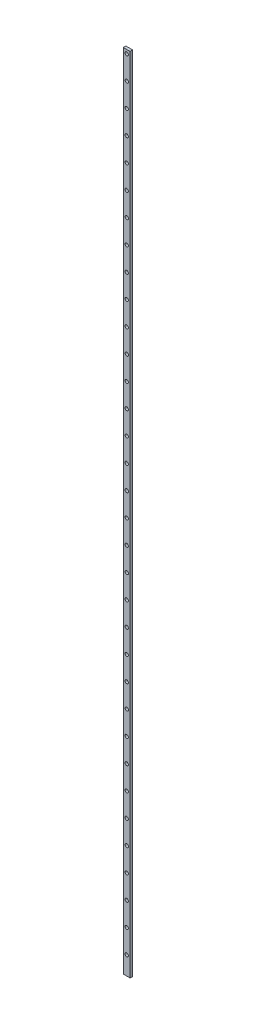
ISO-10303-21;
HEADER;
FILE_DESCRIPTION(('STEP AP214'),'2;1');
FILE_NAME('part.step','',(''),(''),'','','');
FILE_SCHEMA(('AUTOMOTIVE_DESIGN { 1 0 10303 214 1 1 1 1 }'));
ENDSEC;
DATA;
#1=APPLICATION_CONTEXT('core data for automotive mechanical design processes');
#2=APPLICATION_PROTOCOL_DEFINITION('international standard','automotive_design',2000,#1);
#3=PRODUCT_CONTEXT('',#1,'mechanical');
#4=PRODUCT('Part','Part','',(#3));
#5=PRODUCT_RELATED_PRODUCT_CATEGORY('part','',(#4));
#6=PRODUCT_DEFINITION_FORMATION('','',#4);
#7=PRODUCT_DEFINITION_CONTEXT('part definition',#1,'design');
#8=PRODUCT_DEFINITION('design','',#6,#7);
#9=PRODUCT_DEFINITION_SHAPE('','',#8);
#10=(LENGTH_UNIT() NAMED_UNIT(*) SI_UNIT(.MILLI.,.METRE.));
#11=(NAMED_UNIT(*) PLANE_ANGLE_UNIT() SI_UNIT($,.RADIAN.));
#12=(NAMED_UNIT(*) SI_UNIT($,.STERADIAN.) SOLID_ANGLE_UNIT());
#13=UNCERTAINTY_MEASURE_WITH_UNIT(LENGTH_MEASURE(1.E-05),#10,'distance_accuracy_value','');
#14=(GEOMETRIC_REPRESENTATION_CONTEXT(3) GLOBAL_UNCERTAINTY_ASSIGNED_CONTEXT((#13)) GLOBAL_UNIT_ASSIGNED_CONTEXT((#10,
#11,#12)) REPRESENTATION_CONTEXT('',''));
#15=CARTESIAN_POINT('',(0.,0.,0.));
#16=DIRECTION('',(0.,0.,1.));
#17=DIRECTION('',(1.,0.,0.));
#18=AXIS2_PLACEMENT_3D('',#15,#16,#17);
#19=CARTESIAN_POINT('',(0.,0.,4.8));
#20=DIRECTION('',(0.,-1.,0.));
#21=DIRECTION('',(0.,0.,-1.));
#22=AXIS2_PLACEMENT_3D('',#19,#20,#21);
#23=PLANE('',#22);
#24=DIRECTION('',(-1.,0.,0.));
#25=VECTOR('',#24,1.);
#26=CARTESIAN_POINT('',(0.,0.,0.));
#27=LINE('',#26,#25);
#28=CARTESIAN_POINT('',(0.,0.,0.));
#29=VERTEX_POINT('',#28);
#30=CARTESIAN_POINT('',(-12.7,0.,0.));
#31=VERTEX_POINT('',#30);
#32=EDGE_CURVE('E104',#29,#31,#27,.T.);
#33=ORIENTED_EDGE('',*,*,#32,.T.);
#34=DIRECTION('',(0.,0.,-1.));
#35=VECTOR('',#34,1.);
#36=CARTESIAN_POINT('',(-12.7,0.,4.8));
#37=LINE('',#36,#35);
#38=CARTESIAN_POINT('',(-12.7,0.,4.8));
#39=VERTEX_POINT('',#38);
#40=EDGE_CURVE('E95',#39,#31,#37,.T.);
#41=ORIENTED_EDGE('',*,*,#40,.F.);
#42=DIRECTION('',(-1.,0.,0.));
#43=VECTOR('',#42,1.);
#44=CARTESIAN_POINT('',(0.,0.,4.8));
#45=LINE('',#44,#43);
#46=CARTESIAN_POINT('',(0.,0.,4.8));
#47=VERTEX_POINT('',#46);
#48=EDGE_CURVE('E89',#47,#39,#45,.T.);
#49=ORIENTED_EDGE('',*,*,#48,.F.);
#50=DIRECTION('',(0.,0.,-1.));
#51=VECTOR('',#50,1.);
#52=CARTESIAN_POINT('',(0.,0.,4.8));
#53=LINE('',#52,#51);
#54=EDGE_CURVE('E100',#47,#29,#53,.T.);
#55=ORIENTED_EDGE('',*,*,#54,.T.);
#56=EDGE_LOOP('',(#33,#41,#49,#55));
#57=FACE_BOUND('',#56,.T.);
#58=ADVANCED_FACE('F35',(#57),#23,.F.);
#59=CARTESIAN_POINT('',(-12.7,0.,4.8));
#60=DIRECTION('',(1.,0.,0.));
#61=DIRECTION('',(0.,1.,0.));
#62=AXIS2_PLACEMENT_3D('',#59,#60,#61);
#63=PLANE('',#62);
#64=DIRECTION('',(0.,-1.,0.));
#65=VECTOR('',#64,1.);
#66=CARTESIAN_POINT('',(-12.7,0.,0.));
#67=LINE('',#66,#65);
#68=CARTESIAN_POINT('',(-12.6999999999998,-1500.,0.));
#69=VERTEX_POINT('',#68);
#70=EDGE_CURVE('E94',#31,#69,#67,.T.);
#71=ORIENTED_EDGE('',*,*,#70,.T.);
#72=DIRECTION('',(0.,0.,-1.));
#73=VECTOR('',#72,1.);
#74=CARTESIAN_POINT('',(-12.6999999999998,-1500.,4.8));
#75=LINE('',#74,#73);
#76=CARTESIAN_POINT('',(-12.6999999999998,-1500.,4.8));
#77=VERTEX_POINT('',#76);
#78=EDGE_CURVE('E92',#77,#69,#75,.T.);
#79=ORIENTED_EDGE('',*,*,#78,.F.);
#80=DIRECTION('',(0.,-1.,0.));
#81=VECTOR('',#80,1.);
#82=CARTESIAN_POINT('',(-12.7,0.,4.8));
#83=LINE('',#82,#81);
#84=EDGE_CURVE('E83',#39,#77,#83,.T.);
#85=ORIENTED_EDGE('',*,*,#84,.F.);
#86=ORIENTED_EDGE('',*,*,#40,.T.);
#87=EDGE_LOOP('',(#71,#79,#85,#86));
#88=FACE_BOUND('',#87,.T.);
#89=ADVANCED_FACE('F93',(#88),#63,.F.);
#90=CARTESIAN_POINT('',(-12.6999999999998,-1500.,4.8));
#91=DIRECTION('',(0.,1.,0.));
#92=DIRECTION('',(0.,0.,1.));
#93=AXIS2_PLACEMENT_3D('',#90,#91,#92);
#94=PLANE('',#93);
#95=DIRECTION('',(1.,0.,0.));
#96=VECTOR('',#95,1.);
#97=CARTESIAN_POINT('',(-12.6999999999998,-1500.,0.));
#98=LINE('',#97,#96);
#99=CARTESIAN_POINT('',(0.,-1500.,0.));
#100=VERTEX_POINT('',#99);
#101=EDGE_CURVE('E69',#69,#100,#98,.T.);
#102=ORIENTED_EDGE('',*,*,#101,.T.);
#103=DIRECTION('',(0.,0.,-1.));
#104=VECTOR('',#103,1.);
#105=CARTESIAN_POINT('',(0.,-1500.,4.8));
#106=LINE('',#105,#104);
#107=CARTESIAN_POINT('',(0.,-1500.,4.8));
#108=VERTEX_POINT('',#107);
#109=EDGE_CURVE('E96',#108,#100,#106,.T.);
#110=ORIENTED_EDGE('',*,*,#109,.F.);
#111=DIRECTION('',(1.,0.,0.));
#112=VECTOR('',#111,1.);
#113=CARTESIAN_POINT('',(-12.6999999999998,-1500.,4.8));
#114=LINE('',#113,#112);
#115=EDGE_CURVE('E87',#77,#108,#114,.T.);
#116=ORIENTED_EDGE('',*,*,#115,.F.);
#117=ORIENTED_EDGE('',*,*,#78,.T.);
#118=EDGE_LOOP('',(#102,#110,#116,#117));
#119=FACE_BOUND('',#118,.T.);
#120=ADVANCED_FACE('F98',(#119),#94,.F.);
#121=CARTESIAN_POINT('',(0.,-1500.,4.8));
#122=DIRECTION('',(-1.,0.,0.));
#123=DIRECTION('',(0.,0.,1.));
#124=AXIS2_PLACEMENT_3D('',#121,#122,#123);
#125=PLANE('',#124);
#126=DIRECTION('',(0.,1.,0.));
#127=VECTOR('',#126,1.);
#128=CARTESIAN_POINT('',(0.,-1500.,0.));
#129=LINE('',#128,#127);
#130=EDGE_CURVE('E75',#100,#29,#129,.T.);
#131=ORIENTED_EDGE('',*,*,#130,.T.);
#132=ORIENTED_EDGE('',*,*,#54,.F.);
#133=DIRECTION('',(0.,1.,0.));
#134=VECTOR('',#133,1.);
#135=CARTESIAN_POINT('',(0.,-1500.,4.8));
#136=LINE('',#135,#134);
#137=EDGE_CURVE('E52',#108,#47,#136,.T.);
#138=ORIENTED_EDGE('',*,*,#137,.F.);
#139=ORIENTED_EDGE('',*,*,#109,.T.);
#140=EDGE_LOOP('',(#131,#132,#138,#139));
#141=FACE_BOUND('',#140,.T.);
#142=ADVANCED_FACE('F310',(#141),#125,.F.);
#143=CARTESIAN_POINT('',(-12.7,0.,4.8));
#144=DIRECTION('',(0.,0.,1.));
#145=DIRECTION('',(1.,0.,0.));
#146=AXIS2_PLACEMENT_3D('',#143,#144,#145);
#147=PLANE('',#146);
#148=CARTESIAN_POINT('',(-6.35,-1421.45,4.8));
#149=DIRECTION('',(0.,0.,1.));
#150=DIRECTION('',(1.,0.,0.));
#151=AXIS2_PLACEMENT_3D('',#148,#149,#150);
#152=CIRCLE('',#151,3.14999999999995);
#153=CARTESIAN_POINT('',(-3.20000000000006,-1421.45,4.8));
#154=VERTEX_POINT('',#153);
#155=EDGE_CURVE('E708',#154,#154,#152,.T.);
#156=ORIENTED_EDGE('',*,*,#155,.F.);
#157=EDGE_LOOP('',(#156));
#158=FACE_BOUND('',#157,.T.);
#159=CARTESIAN_POINT('',(-6.35,-1465.65,4.8));
#160=DIRECTION('',(0.,0.,1.));
#161=DIRECTION('',(1.,0.,0.));
#162=AXIS2_PLACEMENT_3D('',#159,#160,#161);
#163=CIRCLE('',#162,3.14999999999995);
#164=CARTESIAN_POINT('',(-3.20000000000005,-1465.65,4.8));
#165=VERTEX_POINT('',#164);
#166=EDGE_CURVE('E707',#165,#165,#163,.T.);
#167=ORIENTED_EDGE('',*,*,#166,.F.);
#168=EDGE_LOOP('',(#167));
#169=FACE_BOUND('',#168,.T.);
#170=ORIENTED_EDGE('',*,*,#48,.T.);
#171=ORIENTED_EDGE('',*,*,#84,.T.);
#172=ORIENTED_EDGE('',*,*,#115,.T.);
#173=ORIENTED_EDGE('',*,*,#137,.T.);
#174=EDGE_LOOP('',(#170,#171,#172,#173));
#175=FACE_BOUND('',#174,.T.);
#176=CARTESIAN_POINT('',(-6.35000000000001,-1377.25,4.8));
#177=DIRECTION('',(0.,0.,1.));
#178=DIRECTION('',(1.,0.,0.));
#179=AXIS2_PLACEMENT_3D('',#176,#177,#178);
#180=CIRCLE('',#179,3.14999999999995);
#181=CARTESIAN_POINT('',(-3.20000000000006,-1377.25,4.8));
#182=VERTEX_POINT('',#181);
#183=EDGE_CURVE('E117',#182,#182,#180,.T.);
#184=ORIENTED_EDGE('',*,*,#183,.F.);
#185=EDGE_LOOP('',(#184));
#186=FACE_BOUND('',#185,.T.);
#187=CARTESIAN_POINT('',(-6.35000000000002,-1333.05,4.8));
#188=DIRECTION('',(0.,0.,1.));
#189=DIRECTION('',(1.,0.,0.));
#190=AXIS2_PLACEMENT_3D('',#187,#188,#189);
#191=CIRCLE('',#190,3.14999999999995);
#192=CARTESIAN_POINT('',(-3.20000000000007,-1333.05,4.8));
#193=VERTEX_POINT('',#192);
#194=EDGE_CURVE('E123',#193,#193,#191,.T.);
#195=ORIENTED_EDGE('',*,*,#194,.F.);
#196=EDGE_LOOP('',(#195));
#197=FACE_BOUND('',#196,.T.);
#198=CARTESIAN_POINT('',(-6.35000000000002,-1288.85,4.8));
#199=DIRECTION('',(0.,0.,1.));
#200=DIRECTION('',(1.,0.,0.));
#201=AXIS2_PLACEMENT_3D('',#198,#199,#200);
#202=CIRCLE('',#201,3.14999999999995);
#203=CARTESIAN_POINT('',(-3.20000000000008,-1288.85,4.8));
#204=VERTEX_POINT('',#203);
#205=EDGE_CURVE('E129',#204,#204,#202,.T.);
#206=ORIENTED_EDGE('',*,*,#205,.F.);
#207=EDGE_LOOP('',(#206));
#208=FACE_BOUND('',#207,.T.);
#209=CARTESIAN_POINT('',(-6.35000000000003,-1244.65,4.8));
#210=DIRECTION('',(0.,0.,1.));
#211=DIRECTION('',(1.,0.,0.));
#212=AXIS2_PLACEMENT_3D('',#209,#210,#211);
#213=CIRCLE('',#212,3.14999999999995);
#214=CARTESIAN_POINT('',(-3.20000000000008,-1244.65,4.8));
#215=VERTEX_POINT('',#214);
#216=EDGE_CURVE('E135',#215,#215,#213,.T.);
#217=ORIENTED_EDGE('',*,*,#216,.F.);
#218=EDGE_LOOP('',(#217));
#219=FACE_BOUND('',#218,.T.);
#220=CARTESIAN_POINT('',(-6.35000000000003,-1200.45,4.8));
#221=DIRECTION('',(0.,0.,1.));
#222=DIRECTION('',(1.,0.,0.));
#223=AXIS2_PLACEMENT_3D('',#220,#221,#222);
#224=CIRCLE('',#223,3.14999999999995);
#225=CARTESIAN_POINT('',(-3.20000000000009,-1200.45,4.8));
#226=VERTEX_POINT('',#225);
#227=EDGE_CURVE('E141',#226,#226,#224,.T.);
#228=ORIENTED_EDGE('',*,*,#227,.F.);
#229=EDGE_LOOP('',(#228));
#230=FACE_BOUND('',#229,.T.);
#231=CARTESIAN_POINT('',(-6.35000000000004,-1156.25,4.8));
#232=DIRECTION('',(0.,0.,1.));
#233=DIRECTION('',(1.,0.,0.));
#234=AXIS2_PLACEMENT_3D('',#231,#232,#233);
#235=CIRCLE('',#234,3.14999999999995);
#236=CARTESIAN_POINT('',(-3.20000000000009,-1156.25,4.8));
#237=VERTEX_POINT('',#236);
#238=EDGE_CURVE('E147',#237,#237,#235,.T.);
#239=ORIENTED_EDGE('',*,*,#238,.F.);
#240=EDGE_LOOP('',(#239));
#241=FACE_BOUND('',#240,.T.);
#242=CARTESIAN_POINT('',(-6.35000000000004,-1112.05,4.8));
#243=DIRECTION('',(0.,0.,1.));
#244=DIRECTION('',(1.,0.,0.));
#245=AXIS2_PLACEMENT_3D('',#242,#243,#244);
#246=CIRCLE('',#245,3.14999999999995);
#247=CARTESIAN_POINT('',(-3.2000000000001,-1112.05,4.8));
#248=VERTEX_POINT('',#247);
#249=EDGE_CURVE('E153',#248,#248,#246,.T.);
#250=ORIENTED_EDGE('',*,*,#249,.F.);
#251=EDGE_LOOP('',(#250));
#252=FACE_BOUND('',#251,.T.);
#253=CARTESIAN_POINT('',(-6.35000000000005,-1067.85,4.8));
#254=DIRECTION('',(0.,0.,1.));
#255=DIRECTION('',(1.,0.,0.));
#256=AXIS2_PLACEMENT_3D('',#253,#254,#255);
#257=CIRCLE('',#256,3.14999999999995);
#258=CARTESIAN_POINT('',(-3.2000000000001,-1067.85,4.8));
#259=VERTEX_POINT('',#258);
#260=EDGE_CURVE('E159',#259,#259,#257,.T.);
#261=ORIENTED_EDGE('',*,*,#260,.F.);
#262=EDGE_LOOP('',(#261));
#263=FACE_BOUND('',#262,.T.);
#264=CARTESIAN_POINT('',(-6.35000000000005,-1023.65,4.8));
#265=DIRECTION('',(0.,0.,1.));
#266=DIRECTION('',(1.,0.,0.));
#267=AXIS2_PLACEMENT_3D('',#264,#265,#266);
#268=CIRCLE('',#267,3.14999999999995);
#269=CARTESIAN_POINT('',(-3.20000000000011,-1023.65,4.8));
#270=VERTEX_POINT('',#269);
#271=EDGE_CURVE('E165',#270,#270,#268,.T.);
#272=ORIENTED_EDGE('',*,*,#271,.F.);
#273=EDGE_LOOP('',(#272));
#274=FACE_BOUND('',#273,.T.);
#275=CARTESIAN_POINT('',(-6.35000000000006,-979.45,4.8));
#276=DIRECTION('',(0.,0.,1.));
#277=DIRECTION('',(1.,0.,0.));
#278=AXIS2_PLACEMENT_3D('',#275,#276,#277);
#279=CIRCLE('',#278,3.14999999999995);
#280=CARTESIAN_POINT('',(-3.20000000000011,-979.45,4.8));
#281=VERTEX_POINT('',#280);
#282=EDGE_CURVE('E171',#281,#281,#279,.T.);
#283=ORIENTED_EDGE('',*,*,#282,.F.);
#284=EDGE_LOOP('',(#283));
#285=FACE_BOUND('',#284,.T.);
#286=CARTESIAN_POINT('',(-6.35000000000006,-935.25,4.8));
#287=DIRECTION('',(0.,0.,1.));
#288=DIRECTION('',(1.,0.,0.));
#289=AXIS2_PLACEMENT_3D('',#286,#287,#288);
#290=CIRCLE('',#289,3.14999999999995);
#291=CARTESIAN_POINT('',(-3.20000000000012,-935.25,4.8));
#292=VERTEX_POINT('',#291);
#293=EDGE_CURVE('E177',#292,#292,#290,.T.);
#294=ORIENTED_EDGE('',*,*,#293,.F.);
#295=EDGE_LOOP('',(#294));
#296=FACE_BOUND('',#295,.T.);
#297=CARTESIAN_POINT('',(-6.35000000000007,-891.05,4.8));
#298=DIRECTION('',(0.,0.,1.));
#299=DIRECTION('',(1.,0.,0.));
#300=AXIS2_PLACEMENT_3D('',#297,#298,#299);
#301=CIRCLE('',#300,3.14999999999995);
#302=CARTESIAN_POINT('',(-3.20000000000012,-891.05,4.8));
#303=VERTEX_POINT('',#302);
#304=EDGE_CURVE('E183',#303,#303,#301,.T.);
#305=ORIENTED_EDGE('',*,*,#304,.F.);
#306=EDGE_LOOP('',(#305));
#307=FACE_BOUND('',#306,.T.);
#308=CARTESIAN_POINT('',(-6.35000000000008,-846.85,4.8));
#309=DIRECTION('',(0.,0.,1.));
#310=DIRECTION('',(1.,0.,0.));
#311=AXIS2_PLACEMENT_3D('',#308,#309,#310);
#312=CIRCLE('',#311,3.14999999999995);
#313=CARTESIAN_POINT('',(-3.20000000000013,-846.85,4.8));
#314=VERTEX_POINT('',#313);
#315=EDGE_CURVE('E189',#314,#314,#312,.T.);
#316=ORIENTED_EDGE('',*,*,#315,.F.);
#317=EDGE_LOOP('',(#316));
#318=FACE_BOUND('',#317,.T.);
#319=CARTESIAN_POINT('',(-6.35000000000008,-802.65,4.8));
#320=DIRECTION('',(0.,0.,1.));
#321=DIRECTION('',(1.,0.,0.));
#322=AXIS2_PLACEMENT_3D('',#319,#320,#321);
#323=CIRCLE('',#322,3.14999999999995);
#324=CARTESIAN_POINT('',(-3.20000000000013,-802.65,4.8));
#325=VERTEX_POINT('',#324);
#326=EDGE_CURVE('E195',#325,#325,#323,.T.);
#327=ORIENTED_EDGE('',*,*,#326,.F.);
#328=EDGE_LOOP('',(#327));
#329=FACE_BOUND('',#328,.T.);
#330=CARTESIAN_POINT('',(-6.35000000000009,-758.45,4.8));
#331=DIRECTION('',(0.,0.,1.));
#332=DIRECTION('',(1.,0.,0.));
#333=AXIS2_PLACEMENT_3D('',#330,#331,#332);
#334=CIRCLE('',#333,3.14999999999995);
#335=CARTESIAN_POINT('',(-3.20000000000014,-758.45,4.8));
#336=VERTEX_POINT('',#335);
#337=EDGE_CURVE('E201',#336,#336,#334,.T.);
#338=ORIENTED_EDGE('',*,*,#337,.F.);
#339=EDGE_LOOP('',(#338));
#340=FACE_BOUND('',#339,.T.);
#341=CARTESIAN_POINT('',(-6.35000000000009,-714.25,4.8));
#342=DIRECTION('',(0.,0.,1.));
#343=DIRECTION('',(1.,0.,0.));
#344=AXIS2_PLACEMENT_3D('',#341,#342,#343);
#345=CIRCLE('',#344,3.14999999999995);
#346=CARTESIAN_POINT('',(-3.20000000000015,-714.25,4.8));
#347=VERTEX_POINT('',#346);
#348=EDGE_CURVE('E207',#347,#347,#345,.T.);
#349=ORIENTED_EDGE('',*,*,#348,.F.);
#350=EDGE_LOOP('',(#349));
#351=FACE_BOUND('',#350,.T.);
#352=CARTESIAN_POINT('',(-6.3500000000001,-670.05,4.8));
#353=DIRECTION('',(0.,0.,1.));
#354=DIRECTION('',(1.,0.,0.));
#355=AXIS2_PLACEMENT_3D('',#352,#353,#354);
#356=CIRCLE('',#355,3.14999999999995);
#357=CARTESIAN_POINT('',(-3.20000000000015,-670.05,4.8));
#358=VERTEX_POINT('',#357);
#359=EDGE_CURVE('E213',#358,#358,#356,.T.);
#360=ORIENTED_EDGE('',*,*,#359,.F.);
#361=EDGE_LOOP('',(#360));
#362=FACE_BOUND('',#361,.T.);
#363=CARTESIAN_POINT('',(-6.3500000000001,-625.85,4.8));
#364=DIRECTION('',(0.,0.,1.));
#365=DIRECTION('',(1.,0.,0.));
#366=AXIS2_PLACEMENT_3D('',#363,#364,#365);
#367=CIRCLE('',#366,3.14999999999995);
#368=CARTESIAN_POINT('',(-3.20000000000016,-625.85,4.8));
#369=VERTEX_POINT('',#368);
#370=EDGE_CURVE('E219',#369,#369,#367,.T.);
#371=ORIENTED_EDGE('',*,*,#370,.F.);
#372=EDGE_LOOP('',(#371));
#373=FACE_BOUND('',#372,.T.);
#374=CARTESIAN_POINT('',(-6.35000000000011,-581.65,4.8));
#375=DIRECTION('',(0.,0.,1.));
#376=DIRECTION('',(1.,0.,0.));
#377=AXIS2_PLACEMENT_3D('',#374,#375,#376);
#378=CIRCLE('',#377,3.14999999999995);
#379=CARTESIAN_POINT('',(-3.20000000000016,-581.65,4.8));
#380=VERTEX_POINT('',#379);
#381=EDGE_CURVE('E225',#380,#380,#378,.T.);
#382=ORIENTED_EDGE('',*,*,#381,.F.);
#383=EDGE_LOOP('',(#382));
#384=FACE_BOUND('',#383,.T.);
#385=CARTESIAN_POINT('',(-6.35000000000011,-537.45,4.8));
#386=DIRECTION('',(0.,0.,1.));
#387=DIRECTION('',(1.,0.,0.));
#388=AXIS2_PLACEMENT_3D('',#385,#386,#387);
#389=CIRCLE('',#388,3.14999999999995);
#390=CARTESIAN_POINT('',(-3.20000000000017,-537.45,4.8));
#391=VERTEX_POINT('',#390);
#392=EDGE_CURVE('E231',#391,#391,#389,.T.);
#393=ORIENTED_EDGE('',*,*,#392,.F.);
#394=EDGE_LOOP('',(#393));
#395=FACE_BOUND('',#394,.T.);
#396=CARTESIAN_POINT('',(-6.35000000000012,-493.25,4.8));
#397=DIRECTION('',(0.,0.,1.));
#398=DIRECTION('',(1.,0.,0.));
#399=AXIS2_PLACEMENT_3D('',#396,#397,#398);
#400=CIRCLE('',#399,3.14999999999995);
#401=CARTESIAN_POINT('',(-3.20000000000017,-493.25,4.8));
#402=VERTEX_POINT('',#401);
#403=EDGE_CURVE('E237',#402,#402,#400,.T.);
#404=ORIENTED_EDGE('',*,*,#403,.F.);
#405=EDGE_LOOP('',(#404));
#406=FACE_BOUND('',#405,.T.);
#407=CARTESIAN_POINT('',(-6.35000000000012,-449.05,4.8));
#408=DIRECTION('',(0.,0.,1.));
#409=DIRECTION('',(1.,0.,0.));
#410=AXIS2_PLACEMENT_3D('',#407,#408,#409);
#411=CIRCLE('',#410,3.14999999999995);
#412=CARTESIAN_POINT('',(-3.20000000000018,-449.05,4.8));
#413=VERTEX_POINT('',#412);
#414=EDGE_CURVE('E243',#413,#413,#411,.T.);
#415=ORIENTED_EDGE('',*,*,#414,.F.);
#416=EDGE_LOOP('',(#415));
#417=FACE_BOUND('',#416,.T.);
#418=CARTESIAN_POINT('',(-6.35000000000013,-404.85,4.8));
#419=DIRECTION('',(0.,0.,1.));
#420=DIRECTION('',(1.,0.,0.));
#421=AXIS2_PLACEMENT_3D('',#418,#419,#420);
#422=CIRCLE('',#421,3.14999999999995);
#423=CARTESIAN_POINT('',(-3.20000000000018,-404.85,4.8));
#424=VERTEX_POINT('',#423);
#425=EDGE_CURVE('E249',#424,#424,#422,.T.);
#426=ORIENTED_EDGE('',*,*,#425,.F.);
#427=EDGE_LOOP('',(#426));
#428=FACE_BOUND('',#427,.T.);
#429=CARTESIAN_POINT('',(-6.35000000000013,-360.65,4.8));
#430=DIRECTION('',(0.,0.,1.));
#431=DIRECTION('',(1.,0.,0.));
#432=AXIS2_PLACEMENT_3D('',#429,#430,#431);
#433=CIRCLE('',#432,3.14999999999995);
#434=CARTESIAN_POINT('',(-3.20000000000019,-360.65,4.8));
#435=VERTEX_POINT('',#434);
#436=EDGE_CURVE('E255',#435,#435,#433,.T.);
#437=ORIENTED_EDGE('',*,*,#436,.F.);
#438=EDGE_LOOP('',(#437));
#439=FACE_BOUND('',#438,.T.);
#440=CARTESIAN_POINT('',(-6.35000000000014,-316.45,4.8));
#441=DIRECTION('',(0.,0.,1.));
#442=DIRECTION('',(1.,0.,0.));
#443=AXIS2_PLACEMENT_3D('',#440,#441,#442);
#444=CIRCLE('',#443,3.14999999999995);
#445=CARTESIAN_POINT('',(-3.20000000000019,-316.45,4.8));
#446=VERTEX_POINT('',#445);
#447=EDGE_CURVE('E261',#446,#446,#444,.T.);
#448=ORIENTED_EDGE('',*,*,#447,.F.);
#449=EDGE_LOOP('',(#448));
#450=FACE_BOUND('',#449,.T.);
#451=CARTESIAN_POINT('',(-6.35000000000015,-272.25,4.8));
#452=DIRECTION('',(0.,0.,1.));
#453=DIRECTION('',(1.,0.,0.));
#454=AXIS2_PLACEMENT_3D('',#451,#452,#453);
#455=CIRCLE('',#454,3.14999999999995);
#456=CARTESIAN_POINT('',(-3.2000000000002,-272.25,4.8));
#457=VERTEX_POINT('',#456);
#458=EDGE_CURVE('E267',#457,#457,#455,.T.);
#459=ORIENTED_EDGE('',*,*,#458,.F.);
#460=EDGE_LOOP('',(#459));
#461=FACE_BOUND('',#460,.T.);
#462=CARTESIAN_POINT('',(-6.35000000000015,-228.05,4.8));
#463=DIRECTION('',(0.,0.,1.));
#464=DIRECTION('',(1.,0.,0.));
#465=AXIS2_PLACEMENT_3D('',#462,#463,#464);
#466=CIRCLE('',#465,3.14999999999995);
#467=CARTESIAN_POINT('',(-3.20000000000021,-228.05,4.8));
#468=VERTEX_POINT('',#467);
#469=EDGE_CURVE('E273',#468,#468,#466,.T.);
#470=ORIENTED_EDGE('',*,*,#469,.F.);
#471=EDGE_LOOP('',(#470));
#472=FACE_BOUND('',#471,.T.);
#473=CARTESIAN_POINT('',(-6.35000000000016,-183.85,4.8));
#474=DIRECTION('',(0.,0.,1.));
#475=DIRECTION('',(1.,0.,0.));
#476=AXIS2_PLACEMENT_3D('',#473,#474,#475);
#477=CIRCLE('',#476,3.14999999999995);
#478=CARTESIAN_POINT('',(-3.20000000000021,-183.85,4.8));
#479=VERTEX_POINT('',#478);
#480=EDGE_CURVE('E279',#479,#479,#477,.T.);
#481=ORIENTED_EDGE('',*,*,#480,.F.);
#482=EDGE_LOOP('',(#481));
#483=FACE_BOUND('',#482,.T.);
#484=CARTESIAN_POINT('',(-6.35000000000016,-139.65,4.8));
#485=DIRECTION('',(0.,0.,1.));
#486=DIRECTION('',(1.,0.,0.));
#487=AXIS2_PLACEMENT_3D('',#484,#485,#486);
#488=CIRCLE('',#487,3.14999999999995);
#489=CARTESIAN_POINT('',(-3.20000000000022,-139.65,4.8));
#490=VERTEX_POINT('',#489);
#491=EDGE_CURVE('E285',#490,#490,#488,.T.);
#492=ORIENTED_EDGE('',*,*,#491,.F.);
#493=EDGE_LOOP('',(#492));
#494=FACE_BOUND('',#493,.T.);
#495=CARTESIAN_POINT('',(-6.35000000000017,-95.4499999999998,4.8));
#496=DIRECTION('',(0.,0.,1.));
#497=DIRECTION('',(1.,0.,0.));
#498=AXIS2_PLACEMENT_3D('',#495,#496,#497);
#499=CIRCLE('',#498,3.14999999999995);
#500=CARTESIAN_POINT('',(-3.20000000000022,-95.4499999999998,4.8));
#501=VERTEX_POINT('',#500);
#502=EDGE_CURVE('E291',#501,#501,#499,.T.);
#503=ORIENTED_EDGE('',*,*,#502,.F.);
#504=EDGE_LOOP('',(#503));
#505=FACE_BOUND('',#504,.T.);
#506=CARTESIAN_POINT('',(-6.35000000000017,-51.2499999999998,4.8));
#507=DIRECTION('',(0.,0.,1.));
#508=DIRECTION('',(1.,0.,0.));
#509=AXIS2_PLACEMENT_3D('',#506,#507,#508);
#510=CIRCLE('',#509,3.14999999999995);
#511=CARTESIAN_POINT('',(-3.20000000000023,-51.2499999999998,4.8));
#512=VERTEX_POINT('',#511);
#513=EDGE_CURVE('E297',#512,#512,#510,.T.);
#514=ORIENTED_EDGE('',*,*,#513,.F.);
#515=EDGE_LOOP('',(#514));
#516=FACE_BOUND('',#515,.T.);
#517=CARTESIAN_POINT('',(-6.35000000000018,-7.04999999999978,4.8));
#518=DIRECTION('',(0.,0.,1.));
#519=DIRECTION('',(1.,0.,0.));
#520=AXIS2_PLACEMENT_3D('',#517,#518,#519);
#521=CIRCLE('',#520,3.14999999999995);
#522=CARTESIAN_POINT('',(-3.20000000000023,-7.04999999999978,4.8));
#523=VERTEX_POINT('',#522);
#524=EDGE_CURVE('E11',#523,#523,#521,.T.);
#525=ORIENTED_EDGE('',*,*,#524,.F.);
#526=EDGE_LOOP('',(#525));
#527=FACE_BOUND('',#526,.T.);
#528=ADVANCED_FACE('F84',(#158,#169,#175,#186,#197,#208,#219,#230,#241,#252,#263,#274,#285,#296,
#307,#318,#329,#340,#351,#362,#373,#384,#395,#406,#417,#428,#439,#450,#461,#472,#483,#494,#505,
#516,#527),#147,.T.);
#529=CARTESIAN_POINT('',(-12.7,0.,0.));
#530=DIRECTION('',(0.,0.,1.));
#531=DIRECTION('',(1.,0.,0.));
#532=AXIS2_PLACEMENT_3D('',#529,#530,#531);
#533=PLANE('',#532);
#534=CARTESIAN_POINT('',(-6.35,-1421.45,0.));
#535=DIRECTION('',(0.,0.,1.));
#536=DIRECTION('',(1.,0.,0.));
#537=AXIS2_PLACEMENT_3D('',#534,#535,#536);
#538=CIRCLE('',#537,3.14999999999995);
#539=CARTESIAN_POINT('',(-3.20000000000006,-1421.45,0.));
#540=VERTEX_POINT('',#539);
#541=EDGE_CURVE('E712',#540,#540,#538,.T.);
#542=ORIENTED_EDGE('',*,*,#541,.T.);
#543=EDGE_LOOP('',(#542));
#544=FACE_BOUND('',#543,.T.);
#545=CARTESIAN_POINT('',(-6.35,-1465.65,0.));
#546=DIRECTION('',(0.,0.,1.));
#547=DIRECTION('',(1.,0.,0.));
#548=AXIS2_PLACEMENT_3D('',#545,#546,#547);
#549=CIRCLE('',#548,3.14999999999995);
#550=CARTESIAN_POINT('',(-3.20000000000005,-1465.65,0.));
#551=VERTEX_POINT('',#550);
#552=EDGE_CURVE('E107',#551,#551,#549,.T.);
#553=ORIENTED_EDGE('',*,*,#552,.T.);
#554=EDGE_LOOP('',(#553));
#555=FACE_BOUND('',#554,.T.);
#556=ORIENTED_EDGE('',*,*,#32,.F.);
#557=ORIENTED_EDGE('',*,*,#130,.F.);
#558=ORIENTED_EDGE('',*,*,#101,.F.);
#559=ORIENTED_EDGE('',*,*,#70,.F.);
#560=EDGE_LOOP('',(#556,#557,#558,#559));
#561=FACE_BOUND('',#560,.T.);
#562=CARTESIAN_POINT('',(-6.35000000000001,-1377.25,0.));
#563=DIRECTION('',(0.,0.,1.));
#564=DIRECTION('',(1.,0.,0.));
#565=AXIS2_PLACEMENT_3D('',#562,#563,#564);
#566=CIRCLE('',#565,3.14999999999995);
#567=CARTESIAN_POINT('',(-3.20000000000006,-1377.25,0.));
#568=VERTEX_POINT('',#567);
#569=EDGE_CURVE('E114',#568,#568,#566,.T.);
#570=ORIENTED_EDGE('',*,*,#569,.T.);
#571=EDGE_LOOP('',(#570));
#572=FACE_BOUND('',#571,.T.);
#573=CARTESIAN_POINT('',(-6.35000000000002,-1333.05,0.));
#574=DIRECTION('',(0.,0.,1.));
#575=DIRECTION('',(1.,0.,0.));
#576=AXIS2_PLACEMENT_3D('',#573,#574,#575);
#577=CIRCLE('',#576,3.14999999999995);
#578=CARTESIAN_POINT('',(-3.20000000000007,-1333.05,0.));
#579=VERTEX_POINT('',#578);
#580=EDGE_CURVE('E120',#579,#579,#577,.T.);
#581=ORIENTED_EDGE('',*,*,#580,.T.);
#582=EDGE_LOOP('',(#581));
#583=FACE_BOUND('',#582,.T.);
#584=CARTESIAN_POINT('',(-6.35000000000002,-1288.85,0.));
#585=DIRECTION('',(0.,0.,1.));
#586=DIRECTION('',(1.,0.,0.));
#587=AXIS2_PLACEMENT_3D('',#584,#585,#586);
#588=CIRCLE('',#587,3.14999999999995);
#589=CARTESIAN_POINT('',(-3.20000000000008,-1288.85,0.));
#590=VERTEX_POINT('',#589);
#591=EDGE_CURVE('E126',#590,#590,#588,.T.);
#592=ORIENTED_EDGE('',*,*,#591,.T.);
#593=EDGE_LOOP('',(#592));
#594=FACE_BOUND('',#593,.T.);
#595=CARTESIAN_POINT('',(-6.35000000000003,-1244.65,0.));
#596=DIRECTION('',(0.,0.,1.));
#597=DIRECTION('',(1.,0.,0.));
#598=AXIS2_PLACEMENT_3D('',#595,#596,#597);
#599=CIRCLE('',#598,3.14999999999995);
#600=CARTESIAN_POINT('',(-3.20000000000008,-1244.65,0.));
#601=VERTEX_POINT('',#600);
#602=EDGE_CURVE('E132',#601,#601,#599,.T.);
#603=ORIENTED_EDGE('',*,*,#602,.T.);
#604=EDGE_LOOP('',(#603));
#605=FACE_BOUND('',#604,.T.);
#606=CARTESIAN_POINT('',(-6.35000000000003,-1200.45,0.));
#607=DIRECTION('',(0.,0.,1.));
#608=DIRECTION('',(1.,0.,0.));
#609=AXIS2_PLACEMENT_3D('',#606,#607,#608);
#610=CIRCLE('',#609,3.14999999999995);
#611=CARTESIAN_POINT('',(-3.20000000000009,-1200.45,0.));
#612=VERTEX_POINT('',#611);
#613=EDGE_CURVE('E138',#612,#612,#610,.T.);
#614=ORIENTED_EDGE('',*,*,#613,.T.);
#615=EDGE_LOOP('',(#614));
#616=FACE_BOUND('',#615,.T.);
#617=CARTESIAN_POINT('',(-6.35000000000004,-1156.25,0.));
#618=DIRECTION('',(0.,0.,1.));
#619=DIRECTION('',(1.,0.,0.));
#620=AXIS2_PLACEMENT_3D('',#617,#618,#619);
#621=CIRCLE('',#620,3.14999999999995);
#622=CARTESIAN_POINT('',(-3.20000000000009,-1156.25,0.));
#623=VERTEX_POINT('',#622);
#624=EDGE_CURVE('E144',#623,#623,#621,.T.);
#625=ORIENTED_EDGE('',*,*,#624,.T.);
#626=EDGE_LOOP('',(#625));
#627=FACE_BOUND('',#626,.T.);
#628=CARTESIAN_POINT('',(-6.35000000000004,-1112.05,0.));
#629=DIRECTION('',(0.,0.,1.));
#630=DIRECTION('',(1.,0.,0.));
#631=AXIS2_PLACEMENT_3D('',#628,#629,#630);
#632=CIRCLE('',#631,3.14999999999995);
#633=CARTESIAN_POINT('',(-3.2000000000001,-1112.05,0.));
#634=VERTEX_POINT('',#633);
#635=EDGE_CURVE('E150',#634,#634,#632,.T.);
#636=ORIENTED_EDGE('',*,*,#635,.T.);
#637=EDGE_LOOP('',(#636));
#638=FACE_BOUND('',#637,.T.);
#639=CARTESIAN_POINT('',(-6.35000000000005,-1067.85,0.));
#640=DIRECTION('',(0.,0.,1.));
#641=DIRECTION('',(1.,0.,0.));
#642=AXIS2_PLACEMENT_3D('',#639,#640,#641);
#643=CIRCLE('',#642,3.14999999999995);
#644=CARTESIAN_POINT('',(-3.2000000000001,-1067.85,0.));
#645=VERTEX_POINT('',#644);
#646=EDGE_CURVE('E156',#645,#645,#643,.T.);
#647=ORIENTED_EDGE('',*,*,#646,.T.);
#648=EDGE_LOOP('',(#647));
#649=FACE_BOUND('',#648,.T.);
#650=CARTESIAN_POINT('',(-6.35000000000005,-1023.65,0.));
#651=DIRECTION('',(0.,0.,1.));
#652=DIRECTION('',(1.,0.,0.));
#653=AXIS2_PLACEMENT_3D('',#650,#651,#652);
#654=CIRCLE('',#653,3.14999999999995);
#655=CARTESIAN_POINT('',(-3.20000000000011,-1023.65,0.));
#656=VERTEX_POINT('',#655);
#657=EDGE_CURVE('E162',#656,#656,#654,.T.);
#658=ORIENTED_EDGE('',*,*,#657,.T.);
#659=EDGE_LOOP('',(#658));
#660=FACE_BOUND('',#659,.T.);
#661=CARTESIAN_POINT('',(-6.35000000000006,-979.45,0.));
#662=DIRECTION('',(0.,0.,1.));
#663=DIRECTION('',(1.,0.,0.));
#664=AXIS2_PLACEMENT_3D('',#661,#662,#663);
#665=CIRCLE('',#664,3.14999999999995);
#666=CARTESIAN_POINT('',(-3.20000000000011,-979.45,0.));
#667=VERTEX_POINT('',#666);
#668=EDGE_CURVE('E168',#667,#667,#665,.T.);
#669=ORIENTED_EDGE('',*,*,#668,.T.);
#670=EDGE_LOOP('',(#669));
#671=FACE_BOUND('',#670,.T.);
#672=CARTESIAN_POINT('',(-6.35000000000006,-935.25,0.));
#673=DIRECTION('',(0.,0.,1.));
#674=DIRECTION('',(1.,0.,0.));
#675=AXIS2_PLACEMENT_3D('',#672,#673,#674);
#676=CIRCLE('',#675,3.14999999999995);
#677=CARTESIAN_POINT('',(-3.20000000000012,-935.25,0.));
#678=VERTEX_POINT('',#677);
#679=EDGE_CURVE('E174',#678,#678,#676,.T.);
#680=ORIENTED_EDGE('',*,*,#679,.T.);
#681=EDGE_LOOP('',(#680));
#682=FACE_BOUND('',#681,.T.);
#683=CARTESIAN_POINT('',(-6.35000000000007,-891.05,0.));
#684=DIRECTION('',(0.,0.,1.));
#685=DIRECTION('',(1.,0.,0.));
#686=AXIS2_PLACEMENT_3D('',#683,#684,#685);
#687=CIRCLE('',#686,3.14999999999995);
#688=CARTESIAN_POINT('',(-3.20000000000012,-891.05,0.));
#689=VERTEX_POINT('',#688);
#690=EDGE_CURVE('E180',#689,#689,#687,.T.);
#691=ORIENTED_EDGE('',*,*,#690,.T.);
#692=EDGE_LOOP('',(#691));
#693=FACE_BOUND('',#692,.T.);
#694=CARTESIAN_POINT('',(-6.35000000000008,-846.85,0.));
#695=DIRECTION('',(0.,0.,1.));
#696=DIRECTION('',(1.,0.,0.));
#697=AXIS2_PLACEMENT_3D('',#694,#695,#696);
#698=CIRCLE('',#697,3.14999999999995);
#699=CARTESIAN_POINT('',(-3.20000000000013,-846.85,0.));
#700=VERTEX_POINT('',#699);
#701=EDGE_CURVE('E186',#700,#700,#698,.T.);
#702=ORIENTED_EDGE('',*,*,#701,.T.);
#703=EDGE_LOOP('',(#702));
#704=FACE_BOUND('',#703,.T.);
#705=CARTESIAN_POINT('',(-6.35000000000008,-802.65,0.));
#706=DIRECTION('',(0.,0.,1.));
#707=DIRECTION('',(1.,0.,0.));
#708=AXIS2_PLACEMENT_3D('',#705,#706,#707);
#709=CIRCLE('',#708,3.14999999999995);
#710=CARTESIAN_POINT('',(-3.20000000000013,-802.65,0.));
#711=VERTEX_POINT('',#710);
#712=EDGE_CURVE('E192',#711,#711,#709,.T.);
#713=ORIENTED_EDGE('',*,*,#712,.T.);
#714=EDGE_LOOP('',(#713));
#715=FACE_BOUND('',#714,.T.);
#716=CARTESIAN_POINT('',(-6.35000000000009,-758.45,0.));
#717=DIRECTION('',(0.,0.,1.));
#718=DIRECTION('',(1.,0.,0.));
#719=AXIS2_PLACEMENT_3D('',#716,#717,#718);
#720=CIRCLE('',#719,3.14999999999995);
#721=CARTESIAN_POINT('',(-3.20000000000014,-758.45,0.));
#722=VERTEX_POINT('',#721);
#723=EDGE_CURVE('E198',#722,#722,#720,.T.);
#724=ORIENTED_EDGE('',*,*,#723,.T.);
#725=EDGE_LOOP('',(#724));
#726=FACE_BOUND('',#725,.T.);
#727=CARTESIAN_POINT('',(-6.35000000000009,-714.25,0.));
#728=DIRECTION('',(0.,0.,1.));
#729=DIRECTION('',(1.,0.,0.));
#730=AXIS2_PLACEMENT_3D('',#727,#728,#729);
#731=CIRCLE('',#730,3.14999999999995);
#732=CARTESIAN_POINT('',(-3.20000000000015,-714.25,0.));
#733=VERTEX_POINT('',#732);
#734=EDGE_CURVE('E204',#733,#733,#731,.T.);
#735=ORIENTED_EDGE('',*,*,#734,.T.);
#736=EDGE_LOOP('',(#735));
#737=FACE_BOUND('',#736,.T.);
#738=CARTESIAN_POINT('',(-6.3500000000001,-670.05,0.));
#739=DIRECTION('',(0.,0.,1.));
#740=DIRECTION('',(1.,0.,0.));
#741=AXIS2_PLACEMENT_3D('',#738,#739,#740);
#742=CIRCLE('',#741,3.14999999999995);
#743=CARTESIAN_POINT('',(-3.20000000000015,-670.05,0.));
#744=VERTEX_POINT('',#743);
#745=EDGE_CURVE('E210',#744,#744,#742,.T.);
#746=ORIENTED_EDGE('',*,*,#745,.T.);
#747=EDGE_LOOP('',(#746));
#748=FACE_BOUND('',#747,.T.);
#749=CARTESIAN_POINT('',(-6.3500000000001,-625.85,0.));
#750=DIRECTION('',(0.,0.,1.));
#751=DIRECTION('',(1.,0.,0.));
#752=AXIS2_PLACEMENT_3D('',#749,#750,#751);
#753=CIRCLE('',#752,3.14999999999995);
#754=CARTESIAN_POINT('',(-3.20000000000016,-625.85,0.));
#755=VERTEX_POINT('',#754);
#756=EDGE_CURVE('E216',#755,#755,#753,.T.);
#757=ORIENTED_EDGE('',*,*,#756,.T.);
#758=EDGE_LOOP('',(#757));
#759=FACE_BOUND('',#758,.T.);
#760=CARTESIAN_POINT('',(-6.35000000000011,-581.65,0.));
#761=DIRECTION('',(0.,0.,1.));
#762=DIRECTION('',(1.,0.,0.));
#763=AXIS2_PLACEMENT_3D('',#760,#761,#762);
#764=CIRCLE('',#763,3.14999999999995);
#765=CARTESIAN_POINT('',(-3.20000000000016,-581.65,0.));
#766=VERTEX_POINT('',#765);
#767=EDGE_CURVE('E222',#766,#766,#764,.T.);
#768=ORIENTED_EDGE('',*,*,#767,.T.);
#769=EDGE_LOOP('',(#768));
#770=FACE_BOUND('',#769,.T.);
#771=CARTESIAN_POINT('',(-6.35000000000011,-537.45,0.));
#772=DIRECTION('',(0.,0.,1.));
#773=DIRECTION('',(1.,0.,0.));
#774=AXIS2_PLACEMENT_3D('',#771,#772,#773);
#775=CIRCLE('',#774,3.14999999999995);
#776=CARTESIAN_POINT('',(-3.20000000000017,-537.45,0.));
#777=VERTEX_POINT('',#776);
#778=EDGE_CURVE('E228',#777,#777,#775,.T.);
#779=ORIENTED_EDGE('',*,*,#778,.T.);
#780=EDGE_LOOP('',(#779));
#781=FACE_BOUND('',#780,.T.);
#782=CARTESIAN_POINT('',(-6.35000000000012,-493.25,0.));
#783=DIRECTION('',(0.,0.,1.));
#784=DIRECTION('',(1.,0.,0.));
#785=AXIS2_PLACEMENT_3D('',#782,#783,#784);
#786=CIRCLE('',#785,3.14999999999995);
#787=CARTESIAN_POINT('',(-3.20000000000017,-493.25,0.));
#788=VERTEX_POINT('',#787);
#789=EDGE_CURVE('E234',#788,#788,#786,.T.);
#790=ORIENTED_EDGE('',*,*,#789,.T.);
#791=EDGE_LOOP('',(#790));
#792=FACE_BOUND('',#791,.T.);
#793=CARTESIAN_POINT('',(-6.35000000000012,-449.05,0.));
#794=DIRECTION('',(0.,0.,1.));
#795=DIRECTION('',(1.,0.,0.));
#796=AXIS2_PLACEMENT_3D('',#793,#794,#795);
#797=CIRCLE('',#796,3.14999999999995);
#798=CARTESIAN_POINT('',(-3.20000000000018,-449.05,0.));
#799=VERTEX_POINT('',#798);
#800=EDGE_CURVE('E240',#799,#799,#797,.T.);
#801=ORIENTED_EDGE('',*,*,#800,.T.);
#802=EDGE_LOOP('',(#801));
#803=FACE_BOUND('',#802,.T.);
#804=CARTESIAN_POINT('',(-6.35000000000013,-404.85,0.));
#805=DIRECTION('',(0.,0.,1.));
#806=DIRECTION('',(1.,0.,0.));
#807=AXIS2_PLACEMENT_3D('',#804,#805,#806);
#808=CIRCLE('',#807,3.14999999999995);
#809=CARTESIAN_POINT('',(-3.20000000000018,-404.85,0.));
#810=VERTEX_POINT('',#809);
#811=EDGE_CURVE('E246',#810,#810,#808,.T.);
#812=ORIENTED_EDGE('',*,*,#811,.T.);
#813=EDGE_LOOP('',(#812));
#814=FACE_BOUND('',#813,.T.);
#815=CARTESIAN_POINT('',(-6.35000000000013,-360.65,0.));
#816=DIRECTION('',(0.,0.,1.));
#817=DIRECTION('',(1.,0.,0.));
#818=AXIS2_PLACEMENT_3D('',#815,#816,#817);
#819=CIRCLE('',#818,3.14999999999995);
#820=CARTESIAN_POINT('',(-3.20000000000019,-360.65,0.));
#821=VERTEX_POINT('',#820);
#822=EDGE_CURVE('E252',#821,#821,#819,.T.);
#823=ORIENTED_EDGE('',*,*,#822,.T.);
#824=EDGE_LOOP('',(#823));
#825=FACE_BOUND('',#824,.T.);
#826=CARTESIAN_POINT('',(-6.35000000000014,-316.45,0.));
#827=DIRECTION('',(0.,0.,1.));
#828=DIRECTION('',(1.,0.,0.));
#829=AXIS2_PLACEMENT_3D('',#826,#827,#828);
#830=CIRCLE('',#829,3.14999999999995);
#831=CARTESIAN_POINT('',(-3.20000000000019,-316.45,0.));
#832=VERTEX_POINT('',#831);
#833=EDGE_CURVE('E258',#832,#832,#830,.T.);
#834=ORIENTED_EDGE('',*,*,#833,.T.);
#835=EDGE_LOOP('',(#834));
#836=FACE_BOUND('',#835,.T.);
#837=CARTESIAN_POINT('',(-6.35000000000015,-272.25,0.));
#838=DIRECTION('',(0.,0.,1.));
#839=DIRECTION('',(1.,0.,0.));
#840=AXIS2_PLACEMENT_3D('',#837,#838,#839);
#841=CIRCLE('',#840,3.14999999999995);
#842=CARTESIAN_POINT('',(-3.2000000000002,-272.25,0.));
#843=VERTEX_POINT('',#842);
#844=EDGE_CURVE('E264',#843,#843,#841,.T.);
#845=ORIENTED_EDGE('',*,*,#844,.T.);
#846=EDGE_LOOP('',(#845));
#847=FACE_BOUND('',#846,.T.);
#848=CARTESIAN_POINT('',(-6.35000000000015,-228.05,0.));
#849=DIRECTION('',(0.,0.,1.));
#850=DIRECTION('',(1.,0.,0.));
#851=AXIS2_PLACEMENT_3D('',#848,#849,#850);
#852=CIRCLE('',#851,3.14999999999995);
#853=CARTESIAN_POINT('',(-3.20000000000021,-228.05,0.));
#854=VERTEX_POINT('',#853);
#855=EDGE_CURVE('E270',#854,#854,#852,.T.);
#856=ORIENTED_EDGE('',*,*,#855,.T.);
#857=EDGE_LOOP('',(#856));
#858=FACE_BOUND('',#857,.T.);
#859=CARTESIAN_POINT('',(-6.35000000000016,-183.85,0.));
#860=DIRECTION('',(0.,0.,1.));
#861=DIRECTION('',(1.,0.,0.));
#862=AXIS2_PLACEMENT_3D('',#859,#860,#861);
#863=CIRCLE('',#862,3.14999999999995);
#864=CARTESIAN_POINT('',(-3.20000000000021,-183.85,0.));
#865=VERTEX_POINT('',#864);
#866=EDGE_CURVE('E276',#865,#865,#863,.T.);
#867=ORIENTED_EDGE('',*,*,#866,.T.);
#868=EDGE_LOOP('',(#867));
#869=FACE_BOUND('',#868,.T.);
#870=CARTESIAN_POINT('',(-6.35000000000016,-139.65,0.));
#871=DIRECTION('',(0.,0.,1.));
#872=DIRECTION('',(1.,0.,0.));
#873=AXIS2_PLACEMENT_3D('',#870,#871,#872);
#874=CIRCLE('',#873,3.14999999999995);
#875=CARTESIAN_POINT('',(-3.20000000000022,-139.65,0.));
#876=VERTEX_POINT('',#875);
#877=EDGE_CURVE('E282',#876,#876,#874,.T.);
#878=ORIENTED_EDGE('',*,*,#877,.T.);
#879=EDGE_LOOP('',(#878));
#880=FACE_BOUND('',#879,.T.);
#881=CARTESIAN_POINT('',(-6.35000000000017,-95.4499999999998,0.));
#882=DIRECTION('',(0.,0.,1.));
#883=DIRECTION('',(1.,0.,0.));
#884=AXIS2_PLACEMENT_3D('',#881,#882,#883);
#885=CIRCLE('',#884,3.14999999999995);
#886=CARTESIAN_POINT('',(-3.20000000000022,-95.4499999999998,0.));
#887=VERTEX_POINT('',#886);
#888=EDGE_CURVE('E288',#887,#887,#885,.T.);
#889=ORIENTED_EDGE('',*,*,#888,.T.);
#890=EDGE_LOOP('',(#889));
#891=FACE_BOUND('',#890,.T.);
#892=CARTESIAN_POINT('',(-6.35000000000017,-51.2499999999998,0.));
#893=DIRECTION('',(0.,0.,1.));
#894=DIRECTION('',(1.,0.,0.));
#895=AXIS2_PLACEMENT_3D('',#892,#893,#894);
#896=CIRCLE('',#895,3.14999999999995);
#897=CARTESIAN_POINT('',(-3.20000000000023,-51.2499999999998,0.));
#898=VERTEX_POINT('',#897);
#899=EDGE_CURVE('E294',#898,#898,#896,.T.);
#900=ORIENTED_EDGE('',*,*,#899,.T.);
#901=EDGE_LOOP('',(#900));
#902=FACE_BOUND('',#901,.T.);
#903=CARTESIAN_POINT('',(-6.35000000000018,-7.04999999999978,0.));
#904=DIRECTION('',(0.,0.,1.));
#905=DIRECTION('',(1.,0.,0.));
#906=AXIS2_PLACEMENT_3D('',#903,#904,#905);
#907=CIRCLE('',#906,3.14999999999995);
#908=CARTESIAN_POINT('',(-3.20000000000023,-7.04999999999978,0.));
#909=VERTEX_POINT('',#908);
#910=EDGE_CURVE('E44',#909,#909,#907,.T.);
#911=ORIENTED_EDGE('',*,*,#910,.T.);
#912=EDGE_LOOP('',(#911));
#913=FACE_BOUND('',#912,.T.);
#914=ADVANCED_FACE('F302',(#544,#555,#561,#572,#583,#594,#605,#616,#627,#638,#649,#660,#671,
#682,#693,#704,#715,#726,#737,#748,#759,#770,#781,#792,#803,#814,#825,#836,#847,#858,#869,#880,
#891,#902,#913),#533,.F.);
#915=CARTESIAN_POINT('',(-6.35,-1465.65,0.));
#916=DIRECTION('',(0.,0.,1.));
#917=DIRECTION('',(1.,0.,0.));
#918=AXIS2_PLACEMENT_3D('',#915,#916,#917);
#919=CYLINDRICAL_SURFACE('',#918,3.14999999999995);
#920=ORIENTED_EDGE('',*,*,#552,.F.);
#921=EDGE_LOOP('',(#920));
#922=FACE_BOUND('',#921,.T.);
#923=ORIENTED_EDGE('',*,*,#166,.T.);
#924=EDGE_LOOP('',(#923));
#925=FACE_BOUND('',#924,.T.);
#926=ADVANCED_FACE('F317',(#922,#925),#919,.F.);
#927=CARTESIAN_POINT('',(-6.35,-1421.45,0.));
#928=DIRECTION('',(0.,0.,1.));
#929=DIRECTION('',(1.,0.,0.));
#930=AXIS2_PLACEMENT_3D('',#927,#928,#929);
#931=CYLINDRICAL_SURFACE('',#930,3.14999999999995);
#932=ORIENTED_EDGE('',*,*,#541,.F.);
#933=EDGE_LOOP('',(#932));
#934=FACE_BOUND('',#933,.T.);
#935=ORIENTED_EDGE('',*,*,#155,.T.);
#936=EDGE_LOOP('',(#935));
#937=FACE_BOUND('',#936,.T.);
#938=ADVANCED_FACE('F337',(#934,#937),#931,.F.);
#939=CARTESIAN_POINT('',(-6.35000000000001,-1377.25,0.));
#940=DIRECTION('',(0.,0.,1.));
#941=DIRECTION('',(1.,0.,0.));
#942=AXIS2_PLACEMENT_3D('',#939,#940,#941);
#943=CYLINDRICAL_SURFACE('',#942,3.14999999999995);
#944=ORIENTED_EDGE('',*,*,#569,.F.);
#945=EDGE_LOOP('',(#944));
#946=FACE_BOUND('',#945,.T.);
#947=ORIENTED_EDGE('',*,*,#183,.T.);
#948=EDGE_LOOP('',(#947));
#949=FACE_BOUND('',#948,.T.);
#950=ADVANCED_FACE('F333',(#946,#949),#943,.F.);
#951=CARTESIAN_POINT('',(-6.35000000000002,-1333.05,0.));
#952=DIRECTION('',(0.,0.,1.));
#953=DIRECTION('',(1.,0.,0.));
#954=AXIS2_PLACEMENT_3D('',#951,#952,#953);
#955=CYLINDRICAL_SURFACE('',#954,3.14999999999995);
#956=ORIENTED_EDGE('',*,*,#580,.F.);
#957=EDGE_LOOP('',(#956));
#958=FACE_BOUND('',#957,.T.);
#959=ORIENTED_EDGE('',*,*,#194,.T.);
#960=EDGE_LOOP('',(#959));
#961=FACE_BOUND('',#960,.T.);
#962=ADVANCED_FACE('F336',(#958,#961),#955,.F.);
#963=CARTESIAN_POINT('',(-6.35000000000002,-1288.85,0.));
#964=DIRECTION('',(0.,0.,1.));
#965=DIRECTION('',(1.,0.,0.));
#966=AXIS2_PLACEMENT_3D('',#963,#964,#965);
#967=CYLINDRICAL_SURFACE('',#966,3.14999999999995);
#968=ORIENTED_EDGE('',*,*,#591,.F.);
#969=EDGE_LOOP('',(#968));
#970=FACE_BOUND('',#969,.T.);
#971=ORIENTED_EDGE('',*,*,#205,.T.);
#972=EDGE_LOOP('',(#971));
#973=FACE_BOUND('',#972,.T.);
#974=ADVANCED_FACE('F341',(#970,#973),#967,.F.);
#975=CARTESIAN_POINT('',(-6.35000000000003,-1244.65,0.));
#976=DIRECTION('',(0.,0.,1.));
#977=DIRECTION('',(1.,0.,0.));
#978=AXIS2_PLACEMENT_3D('',#975,#976,#977);
#979=CYLINDRICAL_SURFACE('',#978,3.14999999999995);
#980=ORIENTED_EDGE('',*,*,#602,.F.);
#981=EDGE_LOOP('',(#980));
#982=FACE_BOUND('',#981,.T.);
#983=ORIENTED_EDGE('',*,*,#216,.T.);
#984=EDGE_LOOP('',(#983));
#985=FACE_BOUND('',#984,.T.);
#986=ADVANCED_FACE('F345',(#982,#985),#979,.F.);
#987=CARTESIAN_POINT('',(-6.35000000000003,-1200.45,0.));
#988=DIRECTION('',(0.,0.,1.));
#989=DIRECTION('',(1.,0.,0.));
#990=AXIS2_PLACEMENT_3D('',#987,#988,#989);
#991=CYLINDRICAL_SURFACE('',#990,3.14999999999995);
#992=ORIENTED_EDGE('',*,*,#613,.F.);
#993=EDGE_LOOP('',(#992));
#994=FACE_BOUND('',#993,.T.);
#995=ORIENTED_EDGE('',*,*,#227,.T.);
#996=EDGE_LOOP('',(#995));
#997=FACE_BOUND('',#996,.T.);
#998=ADVANCED_FACE('F349',(#994,#997),#991,.F.);
#999=CARTESIAN_POINT('',(-6.35000000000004,-1156.25,0.));
#1000=DIRECTION('',(0.,0.,1.));
#1001=DIRECTION('',(1.,0.,0.));
#1002=AXIS2_PLACEMENT_3D('',#999,#1000,#1001);
#1003=CYLINDRICAL_SURFACE('',#1002,3.14999999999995);
#1004=ORIENTED_EDGE('',*,*,#624,.F.);
#1005=EDGE_LOOP('',(#1004));
#1006=FACE_BOUND('',#1005,.T.);
#1007=ORIENTED_EDGE('',*,*,#238,.T.);
#1008=EDGE_LOOP('',(#1007));
#1009=FACE_BOUND('',#1008,.T.);
#1010=ADVANCED_FACE('F353',(#1006,#1009),#1003,.F.);
#1011=CARTESIAN_POINT('',(-6.35000000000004,-1112.05,0.));
#1012=DIRECTION('',(0.,0.,1.));
#1013=DIRECTION('',(1.,0.,0.));
#1014=AXIS2_PLACEMENT_3D('',#1011,#1012,#1013);
#1015=CYLINDRICAL_SURFACE('',#1014,3.14999999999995);
#1016=ORIENTED_EDGE('',*,*,#635,.F.);
#1017=EDGE_LOOP('',(#1016));
#1018=FACE_BOUND('',#1017,.T.);
#1019=ORIENTED_EDGE('',*,*,#249,.T.);
#1020=EDGE_LOOP('',(#1019));
#1021=FACE_BOUND('',#1020,.T.);
#1022=ADVANCED_FACE('F357',(#1018,#1021),#1015,.F.);
#1023=CARTESIAN_POINT('',(-6.35000000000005,-1067.85,0.));
#1024=DIRECTION('',(0.,0.,1.));
#1025=DIRECTION('',(1.,0.,0.));
#1026=AXIS2_PLACEMENT_3D('',#1023,#1024,#1025);
#1027=CYLINDRICAL_SURFACE('',#1026,3.14999999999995);
#1028=ORIENTED_EDGE('',*,*,#646,.F.);
#1029=EDGE_LOOP('',(#1028));
#1030=FACE_BOUND('',#1029,.T.);
#1031=ORIENTED_EDGE('',*,*,#260,.T.);
#1032=EDGE_LOOP('',(#1031));
#1033=FACE_BOUND('',#1032,.T.);
#1034=ADVANCED_FACE('F361',(#1030,#1033),#1027,.F.);
#1035=CARTESIAN_POINT('',(-6.35000000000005,-1023.65,0.));
#1036=DIRECTION('',(0.,0.,1.));
#1037=DIRECTION('',(1.,0.,0.));
#1038=AXIS2_PLACEMENT_3D('',#1035,#1036,#1037);
#1039=CYLINDRICAL_SURFACE('',#1038,3.14999999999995);
#1040=ORIENTED_EDGE('',*,*,#657,.F.);
#1041=EDGE_LOOP('',(#1040));
#1042=FACE_BOUND('',#1041,.T.);
#1043=ORIENTED_EDGE('',*,*,#271,.T.);
#1044=EDGE_LOOP('',(#1043));
#1045=FACE_BOUND('',#1044,.T.);
#1046=ADVANCED_FACE('F365',(#1042,#1045),#1039,.F.);
#1047=CARTESIAN_POINT('',(-6.35000000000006,-979.45,0.));
#1048=DIRECTION('',(0.,0.,1.));
#1049=DIRECTION('',(1.,0.,0.));
#1050=AXIS2_PLACEMENT_3D('',#1047,#1048,#1049);
#1051=CYLINDRICAL_SURFACE('',#1050,3.14999999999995);
#1052=ORIENTED_EDGE('',*,*,#668,.F.);
#1053=EDGE_LOOP('',(#1052));
#1054=FACE_BOUND('',#1053,.T.);
#1055=ORIENTED_EDGE('',*,*,#282,.T.);
#1056=EDGE_LOOP('',(#1055));
#1057=FACE_BOUND('',#1056,.T.);
#1058=ADVANCED_FACE('F369',(#1054,#1057),#1051,.F.);
#1059=CARTESIAN_POINT('',(-6.35000000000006,-935.25,0.));
#1060=DIRECTION('',(0.,0.,1.));
#1061=DIRECTION('',(1.,0.,0.));
#1062=AXIS2_PLACEMENT_3D('',#1059,#1060,#1061);
#1063=CYLINDRICAL_SURFACE('',#1062,3.14999999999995);
#1064=ORIENTED_EDGE('',*,*,#679,.F.);
#1065=EDGE_LOOP('',(#1064));
#1066=FACE_BOUND('',#1065,.T.);
#1067=ORIENTED_EDGE('',*,*,#293,.T.);
#1068=EDGE_LOOP('',(#1067));
#1069=FACE_BOUND('',#1068,.T.);
#1070=ADVANCED_FACE('F373',(#1066,#1069),#1063,.F.);
#1071=CARTESIAN_POINT('',(-6.35000000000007,-891.05,0.));
#1072=DIRECTION('',(0.,0.,1.));
#1073=DIRECTION('',(1.,0.,0.));
#1074=AXIS2_PLACEMENT_3D('',#1071,#1072,#1073);
#1075=CYLINDRICAL_SURFACE('',#1074,3.14999999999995);
#1076=ORIENTED_EDGE('',*,*,#690,.F.);
#1077=EDGE_LOOP('',(#1076));
#1078=FACE_BOUND('',#1077,.T.);
#1079=ORIENTED_EDGE('',*,*,#304,.T.);
#1080=EDGE_LOOP('',(#1079));
#1081=FACE_BOUND('',#1080,.T.);
#1082=ADVANCED_FACE('F377',(#1078,#1081),#1075,.F.);
#1083=CARTESIAN_POINT('',(-6.35000000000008,-846.85,0.));
#1084=DIRECTION('',(0.,0.,1.));
#1085=DIRECTION('',(1.,0.,0.));
#1086=AXIS2_PLACEMENT_3D('',#1083,#1084,#1085);
#1087=CYLINDRICAL_SURFACE('',#1086,3.14999999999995);
#1088=ORIENTED_EDGE('',*,*,#701,.F.);
#1089=EDGE_LOOP('',(#1088));
#1090=FACE_BOUND('',#1089,.T.);
#1091=ORIENTED_EDGE('',*,*,#315,.T.);
#1092=EDGE_LOOP('',(#1091));
#1093=FACE_BOUND('',#1092,.T.);
#1094=ADVANCED_FACE('F381',(#1090,#1093),#1087,.F.);
#1095=CARTESIAN_POINT('',(-6.35000000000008,-802.65,0.));
#1096=DIRECTION('',(0.,0.,1.));
#1097=DIRECTION('',(1.,0.,0.));
#1098=AXIS2_PLACEMENT_3D('',#1095,#1096,#1097);
#1099=CYLINDRICAL_SURFACE('',#1098,3.14999999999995);
#1100=ORIENTED_EDGE('',*,*,#712,.F.);
#1101=EDGE_LOOP('',(#1100));
#1102=FACE_BOUND('',#1101,.T.);
#1103=ORIENTED_EDGE('',*,*,#326,.T.);
#1104=EDGE_LOOP('',(#1103));
#1105=FACE_BOUND('',#1104,.T.);
#1106=ADVANCED_FACE('F385',(#1102,#1105),#1099,.F.);
#1107=CARTESIAN_POINT('',(-6.35000000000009,-758.45,0.));
#1108=DIRECTION('',(0.,0.,1.));
#1109=DIRECTION('',(1.,0.,0.));
#1110=AXIS2_PLACEMENT_3D('',#1107,#1108,#1109);
#1111=CYLINDRICAL_SURFACE('',#1110,3.14999999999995);
#1112=ORIENTED_EDGE('',*,*,#723,.F.);
#1113=EDGE_LOOP('',(#1112));
#1114=FACE_BOUND('',#1113,.T.);
#1115=ORIENTED_EDGE('',*,*,#337,.T.);
#1116=EDGE_LOOP('',(#1115));
#1117=FACE_BOUND('',#1116,.T.);
#1118=ADVANCED_FACE('F389',(#1114,#1117),#1111,.F.);
#1119=CARTESIAN_POINT('',(-6.35000000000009,-714.25,0.));
#1120=DIRECTION('',(0.,0.,1.));
#1121=DIRECTION('',(1.,0.,0.));
#1122=AXIS2_PLACEMENT_3D('',#1119,#1120,#1121);
#1123=CYLINDRICAL_SURFACE('',#1122,3.14999999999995);
#1124=ORIENTED_EDGE('',*,*,#734,.F.);
#1125=EDGE_LOOP('',(#1124));
#1126=FACE_BOUND('',#1125,.T.);
#1127=ORIENTED_EDGE('',*,*,#348,.T.);
#1128=EDGE_LOOP('',(#1127));
#1129=FACE_BOUND('',#1128,.T.);
#1130=ADVANCED_FACE('F393',(#1126,#1129),#1123,.F.);
#1131=CARTESIAN_POINT('',(-6.3500000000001,-670.05,0.));
#1132=DIRECTION('',(0.,0.,1.));
#1133=DIRECTION('',(1.,0.,0.));
#1134=AXIS2_PLACEMENT_3D('',#1131,#1132,#1133);
#1135=CYLINDRICAL_SURFACE('',#1134,3.14999999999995);
#1136=ORIENTED_EDGE('',*,*,#745,.F.);
#1137=EDGE_LOOP('',(#1136));
#1138=FACE_BOUND('',#1137,.T.);
#1139=ORIENTED_EDGE('',*,*,#359,.T.);
#1140=EDGE_LOOP('',(#1139));
#1141=FACE_BOUND('',#1140,.T.);
#1142=ADVANCED_FACE('F397',(#1138,#1141),#1135,.F.);
#1143=CARTESIAN_POINT('',(-6.3500000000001,-625.85,0.));
#1144=DIRECTION('',(0.,0.,1.));
#1145=DIRECTION('',(1.,0.,0.));
#1146=AXIS2_PLACEMENT_3D('',#1143,#1144,#1145);
#1147=CYLINDRICAL_SURFACE('',#1146,3.14999999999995);
#1148=ORIENTED_EDGE('',*,*,#756,.F.);
#1149=EDGE_LOOP('',(#1148));
#1150=FACE_BOUND('',#1149,.T.);
#1151=ORIENTED_EDGE('',*,*,#370,.T.);
#1152=EDGE_LOOP('',(#1151));
#1153=FACE_BOUND('',#1152,.T.);
#1154=ADVANCED_FACE('F401',(#1150,#1153),#1147,.F.);
#1155=CARTESIAN_POINT('',(-6.35000000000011,-581.65,0.));
#1156=DIRECTION('',(0.,0.,1.));
#1157=DIRECTION('',(1.,0.,0.));
#1158=AXIS2_PLACEMENT_3D('',#1155,#1156,#1157);
#1159=CYLINDRICAL_SURFACE('',#1158,3.14999999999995);
#1160=ORIENTED_EDGE('',*,*,#767,.F.);
#1161=EDGE_LOOP('',(#1160));
#1162=FACE_BOUND('',#1161,.T.);
#1163=ORIENTED_EDGE('',*,*,#381,.T.);
#1164=EDGE_LOOP('',(#1163));
#1165=FACE_BOUND('',#1164,.T.);
#1166=ADVANCED_FACE('F405',(#1162,#1165),#1159,.F.);
#1167=CARTESIAN_POINT('',(-6.35000000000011,-537.45,0.));
#1168=DIRECTION('',(0.,0.,1.));
#1169=DIRECTION('',(1.,0.,0.));
#1170=AXIS2_PLACEMENT_3D('',#1167,#1168,#1169);
#1171=CYLINDRICAL_SURFACE('',#1170,3.14999999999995);
#1172=ORIENTED_EDGE('',*,*,#778,.F.);
#1173=EDGE_LOOP('',(#1172));
#1174=FACE_BOUND('',#1173,.T.);
#1175=ORIENTED_EDGE('',*,*,#392,.T.);
#1176=EDGE_LOOP('',(#1175));
#1177=FACE_BOUND('',#1176,.T.);
#1178=ADVANCED_FACE('F409',(#1174,#1177),#1171,.F.);
#1179=CARTESIAN_POINT('',(-6.35000000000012,-493.25,0.));
#1180=DIRECTION('',(0.,0.,1.));
#1181=DIRECTION('',(1.,0.,0.));
#1182=AXIS2_PLACEMENT_3D('',#1179,#1180,#1181);
#1183=CYLINDRICAL_SURFACE('',#1182,3.14999999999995);
#1184=ORIENTED_EDGE('',*,*,#789,.F.);
#1185=EDGE_LOOP('',(#1184));
#1186=FACE_BOUND('',#1185,.T.);
#1187=ORIENTED_EDGE('',*,*,#403,.T.);
#1188=EDGE_LOOP('',(#1187));
#1189=FACE_BOUND('',#1188,.T.);
#1190=ADVANCED_FACE('F413',(#1186,#1189),#1183,.F.);
#1191=CARTESIAN_POINT('',(-6.35000000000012,-449.05,0.));
#1192=DIRECTION('',(0.,0.,1.));
#1193=DIRECTION('',(1.,0.,0.));
#1194=AXIS2_PLACEMENT_3D('',#1191,#1192,#1193);
#1195=CYLINDRICAL_SURFACE('',#1194,3.14999999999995);
#1196=ORIENTED_EDGE('',*,*,#800,.F.);
#1197=EDGE_LOOP('',(#1196));
#1198=FACE_BOUND('',#1197,.T.);
#1199=ORIENTED_EDGE('',*,*,#414,.T.);
#1200=EDGE_LOOP('',(#1199));
#1201=FACE_BOUND('',#1200,.T.);
#1202=ADVANCED_FACE('F417',(#1198,#1201),#1195,.F.);
#1203=CARTESIAN_POINT('',(-6.35000000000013,-404.85,0.));
#1204=DIRECTION('',(0.,0.,1.));
#1205=DIRECTION('',(1.,0.,0.));
#1206=AXIS2_PLACEMENT_3D('',#1203,#1204,#1205);
#1207=CYLINDRICAL_SURFACE('',#1206,3.14999999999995);
#1208=ORIENTED_EDGE('',*,*,#811,.F.);
#1209=EDGE_LOOP('',(#1208));
#1210=FACE_BOUND('',#1209,.T.);
#1211=ORIENTED_EDGE('',*,*,#425,.T.);
#1212=EDGE_LOOP('',(#1211));
#1213=FACE_BOUND('',#1212,.T.);
#1214=ADVANCED_FACE('F421',(#1210,#1213),#1207,.F.);
#1215=CARTESIAN_POINT('',(-6.35000000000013,-360.65,0.));
#1216=DIRECTION('',(0.,0.,1.));
#1217=DIRECTION('',(1.,0.,0.));
#1218=AXIS2_PLACEMENT_3D('',#1215,#1216,#1217);
#1219=CYLINDRICAL_SURFACE('',#1218,3.14999999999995);
#1220=ORIENTED_EDGE('',*,*,#822,.F.);
#1221=EDGE_LOOP('',(#1220));
#1222=FACE_BOUND('',#1221,.T.);
#1223=ORIENTED_EDGE('',*,*,#436,.T.);
#1224=EDGE_LOOP('',(#1223));
#1225=FACE_BOUND('',#1224,.T.);
#1226=ADVANCED_FACE('F425',(#1222,#1225),#1219,.F.);
#1227=CARTESIAN_POINT('',(-6.35000000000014,-316.45,0.));
#1228=DIRECTION('',(0.,0.,1.));
#1229=DIRECTION('',(1.,0.,0.));
#1230=AXIS2_PLACEMENT_3D('',#1227,#1228,#1229);
#1231=CYLINDRICAL_SURFACE('',#1230,3.14999999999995);
#1232=ORIENTED_EDGE('',*,*,#833,.F.);
#1233=EDGE_LOOP('',(#1232));
#1234=FACE_BOUND('',#1233,.T.);
#1235=ORIENTED_EDGE('',*,*,#447,.T.);
#1236=EDGE_LOOP('',(#1235));
#1237=FACE_BOUND('',#1236,.T.);
#1238=ADVANCED_FACE('F429',(#1234,#1237),#1231,.F.);
#1239=CARTESIAN_POINT('',(-6.35000000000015,-272.25,0.));
#1240=DIRECTION('',(0.,0.,1.));
#1241=DIRECTION('',(1.,0.,0.));
#1242=AXIS2_PLACEMENT_3D('',#1239,#1240,#1241);
#1243=CYLINDRICAL_SURFACE('',#1242,3.14999999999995);
#1244=ORIENTED_EDGE('',*,*,#844,.F.);
#1245=EDGE_LOOP('',(#1244));
#1246=FACE_BOUND('',#1245,.T.);
#1247=ORIENTED_EDGE('',*,*,#458,.T.);
#1248=EDGE_LOOP('',(#1247));
#1249=FACE_BOUND('',#1248,.T.);
#1250=ADVANCED_FACE('F433',(#1246,#1249),#1243,.F.);
#1251=CARTESIAN_POINT('',(-6.35000000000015,-228.05,0.));
#1252=DIRECTION('',(0.,0.,1.));
#1253=DIRECTION('',(1.,0.,0.));
#1254=AXIS2_PLACEMENT_3D('',#1251,#1252,#1253);
#1255=CYLINDRICAL_SURFACE('',#1254,3.14999999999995);
#1256=ORIENTED_EDGE('',*,*,#855,.F.);
#1257=EDGE_LOOP('',(#1256));
#1258=FACE_BOUND('',#1257,.T.);
#1259=ORIENTED_EDGE('',*,*,#469,.T.);
#1260=EDGE_LOOP('',(#1259));
#1261=FACE_BOUND('',#1260,.T.);
#1262=ADVANCED_FACE('F437',(#1258,#1261),#1255,.F.);
#1263=CARTESIAN_POINT('',(-6.35000000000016,-183.85,0.));
#1264=DIRECTION('',(0.,0.,1.));
#1265=DIRECTION('',(1.,0.,0.));
#1266=AXIS2_PLACEMENT_3D('',#1263,#1264,#1265);
#1267=CYLINDRICAL_SURFACE('',#1266,3.14999999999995);
#1268=ORIENTED_EDGE('',*,*,#866,.F.);
#1269=EDGE_LOOP('',(#1268));
#1270=FACE_BOUND('',#1269,.T.);
#1271=ORIENTED_EDGE('',*,*,#480,.T.);
#1272=EDGE_LOOP('',(#1271));
#1273=FACE_BOUND('',#1272,.T.);
#1274=ADVANCED_FACE('F441',(#1270,#1273),#1267,.F.);
#1275=CARTESIAN_POINT('',(-6.35000000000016,-139.65,0.));
#1276=DIRECTION('',(0.,0.,1.));
#1277=DIRECTION('',(1.,0.,0.));
#1278=AXIS2_PLACEMENT_3D('',#1275,#1276,#1277);
#1279=CYLINDRICAL_SURFACE('',#1278,3.14999999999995);
#1280=ORIENTED_EDGE('',*,*,#877,.F.);
#1281=EDGE_LOOP('',(#1280));
#1282=FACE_BOUND('',#1281,.T.);
#1283=ORIENTED_EDGE('',*,*,#491,.T.);
#1284=EDGE_LOOP('',(#1283));
#1285=FACE_BOUND('',#1284,.T.);
#1286=ADVANCED_FACE('F445',(#1282,#1285),#1279,.F.);
#1287=CARTESIAN_POINT('',(-6.35000000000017,-95.4499999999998,0.));
#1288=DIRECTION('',(0.,0.,1.));
#1289=DIRECTION('',(1.,0.,0.));
#1290=AXIS2_PLACEMENT_3D('',#1287,#1288,#1289);
#1291=CYLINDRICAL_SURFACE('',#1290,3.14999999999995);
#1292=ORIENTED_EDGE('',*,*,#888,.F.);
#1293=EDGE_LOOP('',(#1292));
#1294=FACE_BOUND('',#1293,.T.);
#1295=ORIENTED_EDGE('',*,*,#502,.T.);
#1296=EDGE_LOOP('',(#1295));
#1297=FACE_BOUND('',#1296,.T.);
#1298=ADVANCED_FACE('F449',(#1294,#1297),#1291,.F.);
#1299=CARTESIAN_POINT('',(-6.35000000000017,-51.2499999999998,0.));
#1300=DIRECTION('',(0.,0.,1.));
#1301=DIRECTION('',(1.,0.,0.));
#1302=AXIS2_PLACEMENT_3D('',#1299,#1300,#1301);
#1303=CYLINDRICAL_SURFACE('',#1302,3.14999999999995);
#1304=ORIENTED_EDGE('',*,*,#899,.F.);
#1305=EDGE_LOOP('',(#1304));
#1306=FACE_BOUND('',#1305,.T.);
#1307=ORIENTED_EDGE('',*,*,#513,.T.);
#1308=EDGE_LOOP('',(#1307));
#1309=FACE_BOUND('',#1308,.T.);
#1310=ADVANCED_FACE('F306',(#1306,#1309),#1303,.F.);
#1311=CARTESIAN_POINT('',(-6.35000000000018,-7.04999999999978,0.));
#1312=DIRECTION('',(0.,0.,1.));
#1313=DIRECTION('',(1.,0.,0.));
#1314=AXIS2_PLACEMENT_3D('',#1311,#1312,#1313);
#1315=CYLINDRICAL_SURFACE('',#1314,3.14999999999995);
#1316=ORIENTED_EDGE('',*,*,#910,.F.);
#1317=EDGE_LOOP('',(#1316));
#1318=FACE_BOUND('',#1317,.T.);
#1319=ORIENTED_EDGE('',*,*,#524,.T.);
#1320=EDGE_LOOP('',(#1319));
#1321=FACE_BOUND('',#1320,.T.);
#1322=ADVANCED_FACE('F37',(#1318,#1321),#1315,.F.);
#1323=CLOSED_SHELL('',(#58,#89,#120,#142,#528,#914,#926,#938,#950,#962,#974,#986,#998,#1010,
#1022,#1034,#1046,#1058,#1070,#1082,#1094,#1106,#1118,#1130,#1142,#1154,#1166,#1178,#1190,#1202,
#1214,#1226,#1238,#1250,#1262,#1274,#1286,#1298,#1310,#1322));
#1324=MANIFOLD_SOLID_BREP('B2',#1323);
#1325=ADVANCED_BREP_SHAPE_REPRESENTATION('',(#18,#1324),#14);
#1326=SHAPE_DEFINITION_REPRESENTATION(#9,#1325);
ENDSEC;
END-ISO-10303-21;
